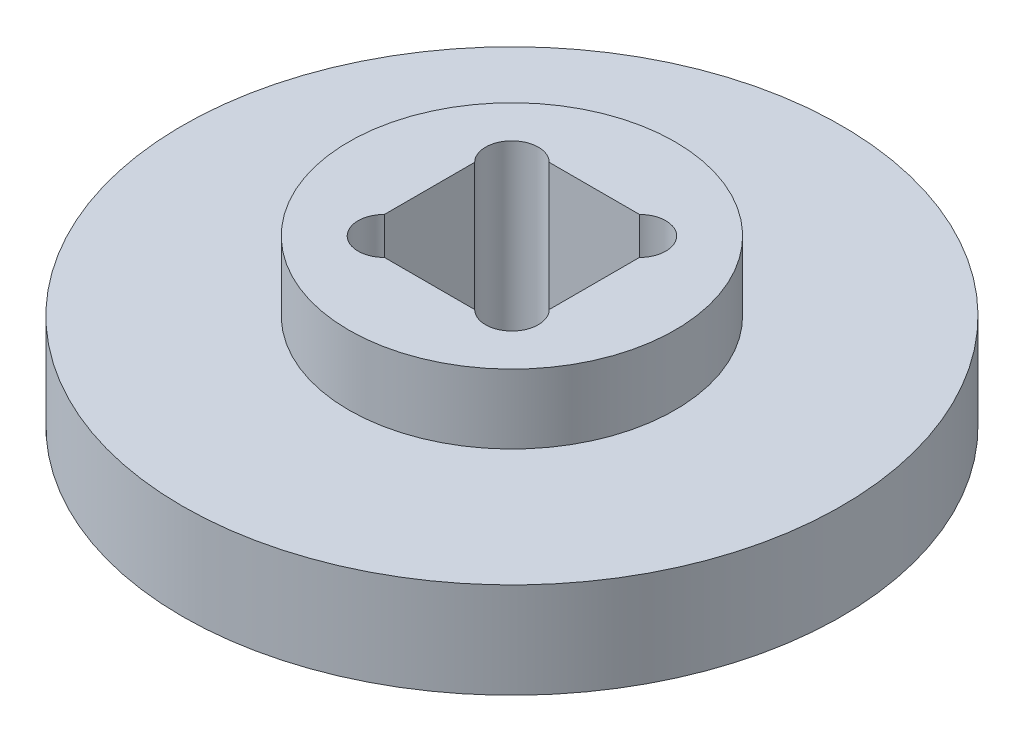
from build123d import *

# Parameters (mm, degrees)
ESQUISSE1_R             = 20
BOSS_EXTRU_1_DEPTH      = 5.8
ESQUISSE2_R             = 9.9
BOSS_EXTRU_2_DEPTH      = 4.2
ENL_V_MAT_EXTRU_1_DEPTH = 31


with BuildPart() as part:
    # Esquisse1 → Boss.-Extru.1 (new body)
    with BuildSketch(Plane(origin=(0, 0, 0), x_dir=(1, 0, 0), z_dir=(0, 1, 0))):
        with Locations(Location((0, 0, 0), (0, 0, 270))):
            Circle(ESQUISSE1_R)
    extrude(amount=BOSS_EXTRU_1_DEPTH)

    # Esquisse2 → Boss.-Extru.2 (add)
    with BuildSketch(Plane(origin=(0, 5.8, 0), x_dir=(1, 0, 0), z_dir=(0, 1, 0))):
        with Locations(Location((0, 0, 0), (0, 0, 270))):
            Circle(ESQUISSE2_R)
    extrude(amount=BOSS_EXTRU_2_DEPTH)

    # Esquisse3 → Enl_v. mat.-Extru.1 (cut, through all)
    with BuildSketch(Plane(origin=(0, 10, 0), x_dir=(1, 0, 0), z_dir=(0, 1, 0))):
        with BuildLine():
            Line((-2.7372583, 5), (2.7372583, 5))
            ThreePointArc((2.7372583, 5), (5, 5), (5, 2.7372583))
            Line((5, 2.7372583), (5, -2.7372583))
            ThreePointArc((5, -2.7372583), (5, -5), (2.7372583, -5))
            Line((2.7372583, -5), (-2.7372583, -5))
            ThreePointArc((-2.7372583, -5), (-5, -5), (-5, -2.7372583))
            Line((-5, -2.7372583), (-5, 2.7372583))
            ThreePointArc((-5, 2.7372583), (-5, 5), (-2.7372583, 5))
        make_face()
    extrude(amount=-ENL_V_MAT_EXTRU_1_DEPTH, mode=Mode.SUBTRACT)


solid = part.part
